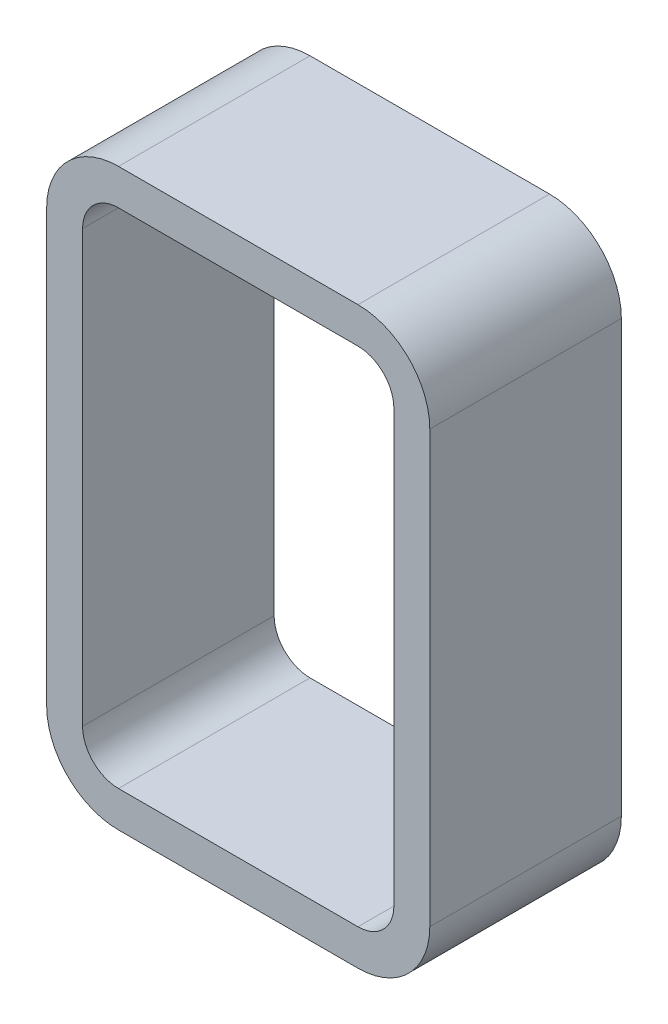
ISO-10303-21;
HEADER;
FILE_DESCRIPTION(('STEP AP214'),'2;1');
FILE_NAME('part.step','',(''),(''),'','','');
FILE_SCHEMA(('AUTOMOTIVE_DESIGN { 1 0 10303 214 1 1 1 1 }'));
ENDSEC;
DATA;
#1=APPLICATION_CONTEXT('core data for automotive mechanical design processes');
#2=APPLICATION_PROTOCOL_DEFINITION('international standard','automotive_design',2000,#1);
#3=PRODUCT_CONTEXT('',#1,'mechanical');
#4=PRODUCT('Part','Part','',(#3));
#5=PRODUCT_RELATED_PRODUCT_CATEGORY('part','',(#4));
#6=PRODUCT_DEFINITION_FORMATION('','',#4);
#7=PRODUCT_DEFINITION_CONTEXT('part definition',#1,'design');
#8=PRODUCT_DEFINITION('design','',#6,#7);
#9=PRODUCT_DEFINITION_SHAPE('','',#8);
#10=(LENGTH_UNIT() NAMED_UNIT(*) SI_UNIT(.MILLI.,.METRE.));
#11=(NAMED_UNIT(*) PLANE_ANGLE_UNIT() SI_UNIT($,.RADIAN.));
#12=(NAMED_UNIT(*) SI_UNIT($,.STERADIAN.) SOLID_ANGLE_UNIT());
#13=UNCERTAINTY_MEASURE_WITH_UNIT(LENGTH_MEASURE(1.E-05),#10,'distance_accuracy_value','');
#14=(GEOMETRIC_REPRESENTATION_CONTEXT(3) GLOBAL_UNCERTAINTY_ASSIGNED_CONTEXT((#13)) GLOBAL_UNIT_ASSIGNED_CONTEXT((#10,
#11,#12)) REPRESENTATION_CONTEXT('',''));
#15=CARTESIAN_POINT('',(0.,0.,0.));
#16=DIRECTION('',(0.,0.,1.));
#17=DIRECTION('',(1.,0.,0.));
#18=AXIS2_PLACEMENT_3D('',#15,#16,#17);
#19=CARTESIAN_POINT('',(41.27496425,66.67500825,12.7));
#20=DIRECTION('',(0.,0.,1.));
#21=DIRECTION('',(1.,0.,0.));
#22=AXIS2_PLACEMENT_3D('',#19,#20,#21);
#23=PLANE('',#22);
#24=CARTESIAN_POINT('',(41.27496425,66.67500825,12.7));
#25=DIRECTION('',(0.,0.,1.));
#26=DIRECTION('',(1.,0.,0.));
#27=AXIS2_PLACEMENT_3D('',#24,#25,#26);
#28=CIRCLE('',#27,9.52499175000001);
#29=CARTESIAN_POINT('',(50.799956,66.67500825,12.7));
#30=VERTEX_POINT('',#29);
#31=CARTESIAN_POINT('',(41.27496425,76.2,12.7));
#32=VERTEX_POINT('',#31);
#33=EDGE_CURVE('E210',#30,#32,#28,.T.);
#34=ORIENTED_EDGE('',*,*,#33,.T.);
#35=DIRECTION('',(-1.,0.,0.));
#36=VECTOR('',#35,1.);
#37=CARTESIAN_POINT('',(41.27496425,76.2,12.7));
#38=LINE('',#37,#36);
#39=CARTESIAN_POINT('',(9.52499174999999,76.2,12.7));
#40=VERTEX_POINT('',#39);
#41=EDGE_CURVE('E213',#32,#40,#38,.T.);
#42=ORIENTED_EDGE('',*,*,#41,.T.);
#43=CARTESIAN_POINT('',(9.52499174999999,66.67500825,12.7));
#44=DIRECTION('',(0.,0.,1.));
#45=DIRECTION('',(1.,0.,0.));
#46=AXIS2_PLACEMENT_3D('',#43,#44,#45);
#47=CIRCLE('',#46,9.52499175);
#48=CARTESIAN_POINT('',(0.,66.67500825,12.7));
#49=VERTEX_POINT('',#48);
#50=EDGE_CURVE('E216',#40,#49,#47,.T.);
#51=ORIENTED_EDGE('',*,*,#50,.T.);
#52=DIRECTION('',(0.,-1.,0.));
#53=VECTOR('',#52,1.);
#54=CARTESIAN_POINT('',(0.,9.52499175,12.7));
#55=LINE('',#54,#53);
#56=CARTESIAN_POINT('',(0.,9.52499175,12.7));
#57=VERTEX_POINT('',#56);
#58=EDGE_CURVE('E218',#49,#57,#55,.T.);
#59=ORIENTED_EDGE('',*,*,#58,.T.);
#60=CARTESIAN_POINT('',(9.52499175,9.52499175,12.7));
#61=DIRECTION('',(0.,0.,1.));
#62=DIRECTION('',(1.,0.,0.));
#63=AXIS2_PLACEMENT_3D('',#60,#61,#62);
#64=CIRCLE('',#63,9.52499175);
#65=CARTESIAN_POINT('',(9.52499175,0.,12.7));
#66=VERTEX_POINT('',#65);
#67=EDGE_CURVE('E220',#57,#66,#64,.T.);
#68=ORIENTED_EDGE('',*,*,#67,.T.);
#69=DIRECTION('',(1.,0.,0.));
#70=VECTOR('',#69,1.);
#71=CARTESIAN_POINT('',(9.52499175,0.,12.7));
#72=LINE('',#71,#70);
#73=CARTESIAN_POINT('',(41.27496425,0.,12.7));
#74=VERTEX_POINT('',#73);
#75=EDGE_CURVE('E222',#66,#74,#72,.T.);
#76=ORIENTED_EDGE('',*,*,#75,.T.);
#77=CARTESIAN_POINT('',(41.27496425,9.52499175,12.7));
#78=DIRECTION('',(0.,0.,1.));
#79=DIRECTION('',(1.,0.,0.));
#80=AXIS2_PLACEMENT_3D('',#77,#78,#79);
#81=CIRCLE('',#80,9.52499175);
#82=CARTESIAN_POINT('',(50.799956,9.52499175,12.7));
#83=VERTEX_POINT('',#82);
#84=EDGE_CURVE('E224',#74,#83,#81,.T.);
#85=ORIENTED_EDGE('',*,*,#84,.T.);
#86=DIRECTION('',(0.,1.,0.));
#87=VECTOR('',#86,1.);
#88=CARTESIAN_POINT('',(50.799956,66.67500825,12.7));
#89=LINE('',#88,#87);
#90=EDGE_CURVE('E226',#83,#30,#89,.T.);
#91=ORIENTED_EDGE('',*,*,#90,.T.);
#92=EDGE_LOOP('',(#34,#42,#51,#59,#68,#76,#85,#91));
#93=FACE_BOUND('',#92,.T.);
#94=DIRECTION('',(0.,-1.,0.));
#95=VECTOR('',#94,1.);
#96=CARTESIAN_POINT('',(4.762495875,9.52499175,12.7));
#97=LINE('',#96,#95);
#98=CARTESIAN_POINT('',(4.76249587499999,66.67500825,12.7));
#99=VERTEX_POINT('',#98);
#100=CARTESIAN_POINT('',(4.762495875,9.52499175,12.7));
#101=VERTEX_POINT('',#100);
#102=EDGE_CURVE('E153',#99,#101,#97,.T.);
#103=ORIENTED_EDGE('',*,*,#102,.F.);
#104=CARTESIAN_POINT('',(9.52499174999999,66.67500825,12.7));
#105=DIRECTION('',(0.,0.,1.));
#106=DIRECTION('',(1.,0.,0.));
#107=AXIS2_PLACEMENT_3D('',#104,#105,#106);
#108=CIRCLE('',#107,4.762495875);
#109=CARTESIAN_POINT('',(9.52499174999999,71.437504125,12.7));
#110=VERTEX_POINT('',#109);
#111=EDGE_CURVE('E145',#110,#99,#108,.T.);
#112=ORIENTED_EDGE('',*,*,#111,.F.);
#113=DIRECTION('',(-1.,0.,0.));
#114=VECTOR('',#113,1.);
#115=CARTESIAN_POINT('',(41.27496425,71.437504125,12.7));
#116=LINE('',#115,#114);
#117=CARTESIAN_POINT('',(41.27496425,71.437504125,12.7));
#118=VERTEX_POINT('',#117);
#119=EDGE_CURVE('E178',#118,#110,#116,.T.);
#120=ORIENTED_EDGE('',*,*,#119,.F.);
#121=CARTESIAN_POINT('',(41.27496425,66.67500825,12.7));
#122=DIRECTION('',(0.,0.,1.));
#123=DIRECTION('',(1.,0.,0.));
#124=AXIS2_PLACEMENT_3D('',#121,#122,#123);
#125=CIRCLE('',#124,4.762495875);
#126=CARTESIAN_POINT('',(46.037460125,66.67500825,12.7));
#127=VERTEX_POINT('',#126);
#128=EDGE_CURVE('E176',#127,#118,#125,.T.);
#129=ORIENTED_EDGE('',*,*,#128,.F.);
#130=DIRECTION('',(0.,1.,0.));
#131=VECTOR('',#130,1.);
#132=CARTESIAN_POINT('',(46.037460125,66.67500825,12.7));
#133=LINE('',#132,#131);
#134=CARTESIAN_POINT('',(46.037460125,9.52499175,12.7));
#135=VERTEX_POINT('',#134);
#136=EDGE_CURVE('E174',#135,#127,#133,.T.);
#137=ORIENTED_EDGE('',*,*,#136,.F.);
#138=CARTESIAN_POINT('',(41.27496425,9.52499175,12.7));
#139=DIRECTION('',(0.,0.,1.));
#140=DIRECTION('',(1.,0.,0.));
#141=AXIS2_PLACEMENT_3D('',#138,#139,#140);
#142=CIRCLE('',#141,4.762495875);
#143=CARTESIAN_POINT('',(41.27496425,4.762495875,12.7));
#144=VERTEX_POINT('',#143);
#145=EDGE_CURVE('E172',#144,#135,#142,.T.);
#146=ORIENTED_EDGE('',*,*,#145,.F.);
#147=DIRECTION('',(1.,0.,0.));
#148=VECTOR('',#147,1.);
#149=CARTESIAN_POINT('',(9.52499175,4.762495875,12.7));
#150=LINE('',#149,#148);
#151=CARTESIAN_POINT('',(9.52499175,4.762495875,12.7));
#152=VERTEX_POINT('',#151);
#153=EDGE_CURVE('E168',#152,#144,#150,.T.);
#154=ORIENTED_EDGE('',*,*,#153,.F.);
#155=CARTESIAN_POINT('',(9.52499175,9.52499175,12.7));
#156=DIRECTION('',(0.,0.,1.));
#157=DIRECTION('',(1.,0.,0.));
#158=AXIS2_PLACEMENT_3D('',#155,#156,#157);
#159=CIRCLE('',#158,4.762495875);
#160=EDGE_CURVE('E166',#101,#152,#159,.T.);
#161=ORIENTED_EDGE('',*,*,#160,.F.);
#162=EDGE_LOOP('',(#103,#112,#120,#129,#137,#146,#154,#161));
#163=FACE_BOUND('',#162,.T.);
#164=ADVANCED_FACE('F32',(#93,#163),#23,.T.);
#165=CARTESIAN_POINT('',(41.27496425,66.67500825,-12.7));
#166=DIRECTION('',(0.,0.,1.));
#167=DIRECTION('',(1.,0.,0.));
#168=AXIS2_PLACEMENT_3D('',#165,#166,#167);
#169=PLANE('',#168);
#170=CARTESIAN_POINT('',(41.27496425,66.67500825,-12.7));
#171=DIRECTION('',(0.,0.,1.));
#172=DIRECTION('',(1.,0.,0.));
#173=AXIS2_PLACEMENT_3D('',#170,#171,#172);
#174=CIRCLE('',#173,9.52499175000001);
#175=CARTESIAN_POINT('',(50.799956,66.67500825,-12.7));
#176=VERTEX_POINT('',#175);
#177=CARTESIAN_POINT('',(41.27496425,76.2,-12.7));
#178=VERTEX_POINT('',#177);
#179=EDGE_CURVE('E161',#176,#178,#174,.T.);
#180=ORIENTED_EDGE('',*,*,#179,.F.);
#181=DIRECTION('',(0.,1.,0.));
#182=VECTOR('',#181,1.);
#183=CARTESIAN_POINT('',(50.799956,66.67500825,-12.7));
#184=LINE('',#183,#182);
#185=CARTESIAN_POINT('',(50.799956,9.52499175,-12.7));
#186=VERTEX_POINT('',#185);
#187=EDGE_CURVE('E214',#186,#176,#184,.T.);
#188=ORIENTED_EDGE('',*,*,#187,.F.);
#189=CARTESIAN_POINT('',(41.27496425,9.52499175,-12.7));
#190=DIRECTION('',(0.,0.,1.));
#191=DIRECTION('',(1.,0.,0.));
#192=AXIS2_PLACEMENT_3D('',#189,#190,#191);
#193=CIRCLE('',#192,9.52499175);
#194=CARTESIAN_POINT('',(41.27496425,0.,-12.7));
#195=VERTEX_POINT('',#194);
#196=EDGE_CURVE('E241',#195,#186,#193,.T.);
#197=ORIENTED_EDGE('',*,*,#196,.F.);
#198=DIRECTION('',(1.,0.,0.));
#199=VECTOR('',#198,1.);
#200=CARTESIAN_POINT('',(9.52499175,0.,-12.7));
#201=LINE('',#200,#199);
#202=CARTESIAN_POINT('',(9.52499175,0.,-12.7));
#203=VERTEX_POINT('',#202);
#204=EDGE_CURVE('E239',#203,#195,#201,.T.);
#205=ORIENTED_EDGE('',*,*,#204,.F.);
#206=CARTESIAN_POINT('',(9.52499175,9.52499175,-12.7));
#207=DIRECTION('',(0.,0.,1.));
#208=DIRECTION('',(1.,0.,0.));
#209=AXIS2_PLACEMENT_3D('',#206,#207,#208);
#210=CIRCLE('',#209,9.52499175);
#211=CARTESIAN_POINT('',(0.,9.52499175,-12.7));
#212=VERTEX_POINT('',#211);
#213=EDGE_CURVE('E237',#212,#203,#210,.T.);
#214=ORIENTED_EDGE('',*,*,#213,.F.);
#215=DIRECTION('',(0.,-1.,0.));
#216=VECTOR('',#215,1.);
#217=CARTESIAN_POINT('',(0.,9.52499175,-12.7));
#218=LINE('',#217,#216);
#219=CARTESIAN_POINT('',(0.,66.67500825,-12.7));
#220=VERTEX_POINT('',#219);
#221=EDGE_CURVE('E235',#220,#212,#218,.T.);
#222=ORIENTED_EDGE('',*,*,#221,.F.);
#223=CARTESIAN_POINT('',(9.52499174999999,66.67500825,-12.7));
#224=DIRECTION('',(0.,0.,1.));
#225=DIRECTION('',(1.,0.,0.));
#226=AXIS2_PLACEMENT_3D('',#223,#224,#225);
#227=CIRCLE('',#226,9.52499175);
#228=CARTESIAN_POINT('',(9.52499174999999,76.2,-12.7));
#229=VERTEX_POINT('',#228);
#230=EDGE_CURVE('E233',#229,#220,#227,.T.);
#231=ORIENTED_EDGE('',*,*,#230,.F.);
#232=DIRECTION('',(-1.,0.,0.));
#233=VECTOR('',#232,1.);
#234=CARTESIAN_POINT('',(41.27496425,76.2,-12.7));
#235=LINE('',#234,#233);
#236=EDGE_CURVE('E231',#178,#229,#235,.T.);
#237=ORIENTED_EDGE('',*,*,#236,.F.);
#238=EDGE_LOOP('',(#180,#188,#197,#205,#214,#222,#231,#237));
#239=FACE_BOUND('',#238,.T.);
#240=CARTESIAN_POINT('',(9.52499174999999,66.67500825,-12.7));
#241=DIRECTION('',(0.,0.,1.));
#242=DIRECTION('',(1.,0.,0.));
#243=AXIS2_PLACEMENT_3D('',#240,#241,#242);
#244=CIRCLE('',#243,4.762495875);
#245=CARTESIAN_POINT('',(9.52499174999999,71.437504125,-12.7));
#246=VERTEX_POINT('',#245);
#247=CARTESIAN_POINT('',(4.76249587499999,66.67500825,-12.7));
#248=VERTEX_POINT('',#247);
#249=EDGE_CURVE('E55',#246,#248,#244,.T.);
#250=ORIENTED_EDGE('',*,*,#249,.T.);
#251=DIRECTION('',(0.,-1.,0.));
#252=VECTOR('',#251,1.);
#253=CARTESIAN_POINT('',(4.762495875,9.52499175,-12.7));
#254=LINE('',#253,#252);
#255=CARTESIAN_POINT('',(4.762495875,9.52499175,-12.7));
#256=VERTEX_POINT('',#255);
#257=EDGE_CURVE('E160',#248,#256,#254,.T.);
#258=ORIENTED_EDGE('',*,*,#257,.T.);
#259=CARTESIAN_POINT('',(9.52499175,9.52499175,-12.7));
#260=DIRECTION('',(0.,0.,1.));
#261=DIRECTION('',(1.,0.,0.));
#262=AXIS2_PLACEMENT_3D('',#259,#260,#261);
#263=CIRCLE('',#262,4.762495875);
#264=CARTESIAN_POINT('',(9.52499175,4.762495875,-12.7));
#265=VERTEX_POINT('',#264);
#266=EDGE_CURVE('E182',#256,#265,#263,.T.);
#267=ORIENTED_EDGE('',*,*,#266,.T.);
#268=DIRECTION('',(1.,0.,0.));
#269=VECTOR('',#268,1.);
#270=CARTESIAN_POINT('',(9.52499175,4.762495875,-12.7));
#271=LINE('',#270,#269);
#272=CARTESIAN_POINT('',(41.27496425,4.762495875,-12.7));
#273=VERTEX_POINT('',#272);
#274=EDGE_CURVE('E185',#265,#273,#271,.T.);
#275=ORIENTED_EDGE('',*,*,#274,.T.);
#276=CARTESIAN_POINT('',(41.27496425,9.52499175,-12.7));
#277=DIRECTION('',(0.,0.,1.));
#278=DIRECTION('',(1.,0.,0.));
#279=AXIS2_PLACEMENT_3D('',#276,#277,#278);
#280=CIRCLE('',#279,4.762495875);
#281=CARTESIAN_POINT('',(46.037460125,9.52499175,-12.7));
#282=VERTEX_POINT('',#281);
#283=EDGE_CURVE('E188',#273,#282,#280,.T.);
#284=ORIENTED_EDGE('',*,*,#283,.T.);
#285=DIRECTION('',(0.,1.,0.));
#286=VECTOR('',#285,1.);
#287=CARTESIAN_POINT('',(46.037460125,66.67500825,-12.7));
#288=LINE('',#287,#286);
#289=CARTESIAN_POINT('',(46.037460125,66.67500825,-12.7));
#290=VERTEX_POINT('',#289);
#291=EDGE_CURVE('E191',#282,#290,#288,.T.);
#292=ORIENTED_EDGE('',*,*,#291,.T.);
#293=CARTESIAN_POINT('',(41.27496425,66.67500825,-12.7));
#294=DIRECTION('',(0.,0.,1.));
#295=DIRECTION('',(1.,0.,0.));
#296=AXIS2_PLACEMENT_3D('',#293,#294,#295);
#297=CIRCLE('',#296,4.762495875);
#298=CARTESIAN_POINT('',(41.27496425,71.437504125,-12.7));
#299=VERTEX_POINT('',#298);
#300=EDGE_CURVE('E194',#290,#299,#297,.T.);
#301=ORIENTED_EDGE('',*,*,#300,.T.);
#302=DIRECTION('',(-1.,0.,0.));
#303=VECTOR('',#302,1.);
#304=CARTESIAN_POINT('',(41.27496425,71.437504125,-12.7));
#305=LINE('',#304,#303);
#306=EDGE_CURVE('E154',#299,#246,#305,.T.);
#307=ORIENTED_EDGE('',*,*,#306,.T.);
#308=EDGE_LOOP('',(#250,#258,#267,#275,#284,#292,#301,#307));
#309=FACE_BOUND('',#308,.T.);
#310=ADVANCED_FACE('F271',(#239,#309),#169,.F.);
#311=CARTESIAN_POINT('',(41.27496425,66.67500825,12.7));
#312=DIRECTION('',(0.,0.,-1.));
#313=DIRECTION('',(-1.,0.,0.));
#314=AXIS2_PLACEMENT_3D('',#311,#312,#313);
#315=CYLINDRICAL_SURFACE('',#314,9.52499175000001);
#316=ORIENTED_EDGE('',*,*,#179,.T.);
#317=DIRECTION('',(0.,0.,-1.));
#318=VECTOR('',#317,1.);
#319=CARTESIAN_POINT('',(41.27496425,76.2,12.7));
#320=LINE('',#319,#318);
#321=EDGE_CURVE('E11',#32,#178,#320,.T.);
#322=ORIENTED_EDGE('',*,*,#321,.F.);
#323=ORIENTED_EDGE('',*,*,#33,.F.);
#324=DIRECTION('',(0.,0.,-1.));
#325=VECTOR('',#324,1.);
#326=CARTESIAN_POINT('',(50.799956,66.67500825,12.7));
#327=LINE('',#326,#325);
#328=EDGE_CURVE('E228',#30,#176,#327,.T.);
#329=ORIENTED_EDGE('',*,*,#328,.T.);
#330=EDGE_LOOP('',(#316,#322,#323,#329));
#331=FACE_BOUND('',#330,.T.);
#332=ADVANCED_FACE('F34',(#331),#315,.T.);
#333=CARTESIAN_POINT('',(41.27496425,76.2,12.7));
#334=DIRECTION('',(0.,-1.,0.));
#335=DIRECTION('',(1.,0.,0.));
#336=AXIS2_PLACEMENT_3D('',#333,#334,#335);
#337=PLANE('',#336);
#338=ORIENTED_EDGE('',*,*,#236,.T.);
#339=DIRECTION('',(0.,0.,-1.));
#340=VECTOR('',#339,1.);
#341=CARTESIAN_POINT('',(9.52499174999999,76.2,12.7));
#342=LINE('',#341,#340);
#343=EDGE_CURVE('E40',#40,#229,#342,.T.);
#344=ORIENTED_EDGE('',*,*,#343,.F.);
#345=ORIENTED_EDGE('',*,*,#41,.F.);
#346=ORIENTED_EDGE('',*,*,#321,.T.);
#347=EDGE_LOOP('',(#338,#344,#345,#346));
#348=FACE_BOUND('',#347,.T.);
#349=ADVANCED_FACE('F288',(#348),#337,.F.);
#350=CARTESIAN_POINT('',(9.52499174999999,66.67500825,12.7));
#351=DIRECTION('',(0.,0.,-1.));
#352=DIRECTION('',(-1.,0.,0.));
#353=AXIS2_PLACEMENT_3D('',#350,#351,#352);
#354=CYLINDRICAL_SURFACE('',#353,9.52499175);
#355=ORIENTED_EDGE('',*,*,#230,.T.);
#356=DIRECTION('',(0.,0.,-1.));
#357=VECTOR('',#356,1.);
#358=CARTESIAN_POINT('',(0.,66.67500825,12.7));
#359=LINE('',#358,#357);
#360=EDGE_CURVE('E258',#49,#220,#359,.T.);
#361=ORIENTED_EDGE('',*,*,#360,.F.);
#362=ORIENTED_EDGE('',*,*,#50,.F.);
#363=ORIENTED_EDGE('',*,*,#343,.T.);
#364=EDGE_LOOP('',(#355,#361,#362,#363));
#365=FACE_BOUND('',#364,.T.);
#366=ADVANCED_FACE('F265',(#365),#354,.T.);
#367=CARTESIAN_POINT('',(0.,9.52499175,12.7));
#368=DIRECTION('',(1.,0.,0.));
#369=DIRECTION('',(0.,1.,0.));
#370=AXIS2_PLACEMENT_3D('',#367,#368,#369);
#371=PLANE('',#370);
#372=ORIENTED_EDGE('',*,*,#221,.T.);
#373=DIRECTION('',(0.,0.,-1.));
#374=VECTOR('',#373,1.);
#375=CARTESIAN_POINT('',(0.,9.52499175,12.7));
#376=LINE('',#375,#374);
#377=EDGE_CURVE('E255',#57,#212,#376,.T.);
#378=ORIENTED_EDGE('',*,*,#377,.F.);
#379=ORIENTED_EDGE('',*,*,#58,.F.);
#380=ORIENTED_EDGE('',*,*,#360,.T.);
#381=EDGE_LOOP('',(#372,#378,#379,#380));
#382=FACE_BOUND('',#381,.T.);
#383=ADVANCED_FACE('F277',(#382),#371,.F.);
#384=CARTESIAN_POINT('',(9.52499175,9.52499175,12.7));
#385=DIRECTION('',(0.,0.,-1.));
#386=DIRECTION('',(-1.,0.,0.));
#387=AXIS2_PLACEMENT_3D('',#384,#385,#386);
#388=CYLINDRICAL_SURFACE('',#387,9.52499175);
#389=ORIENTED_EDGE('',*,*,#213,.T.);
#390=DIRECTION('',(0.,0.,-1.));
#391=VECTOR('',#390,1.);
#392=CARTESIAN_POINT('',(9.52499175,0.,12.7));
#393=LINE('',#392,#391);
#394=EDGE_CURVE('E252',#66,#203,#393,.T.);
#395=ORIENTED_EDGE('',*,*,#394,.F.);
#396=ORIENTED_EDGE('',*,*,#67,.F.);
#397=ORIENTED_EDGE('',*,*,#377,.T.);
#398=EDGE_LOOP('',(#389,#395,#396,#397));
#399=FACE_BOUND('',#398,.T.);
#400=ADVANCED_FACE('F281',(#399),#388,.T.);
#401=CARTESIAN_POINT('',(9.52499175,0.,12.7));
#402=DIRECTION('',(0.,1.,0.));
#403=DIRECTION('',(0.,0.,1.));
#404=AXIS2_PLACEMENT_3D('',#401,#402,#403);
#405=PLANE('',#404);
#406=ORIENTED_EDGE('',*,*,#204,.T.);
#407=DIRECTION('',(0.,0.,-1.));
#408=VECTOR('',#407,1.);
#409=CARTESIAN_POINT('',(41.27496425,0.,12.7));
#410=LINE('',#409,#408);
#411=EDGE_CURVE('E249',#74,#195,#410,.T.);
#412=ORIENTED_EDGE('',*,*,#411,.F.);
#413=ORIENTED_EDGE('',*,*,#75,.F.);
#414=ORIENTED_EDGE('',*,*,#394,.T.);
#415=EDGE_LOOP('',(#406,#412,#413,#414));
#416=FACE_BOUND('',#415,.T.);
#417=ADVANCED_FACE('F301',(#416),#405,.F.);
#418=CARTESIAN_POINT('',(41.27496425,9.52499175,12.7));
#419=DIRECTION('',(0.,0.,-1.));
#420=DIRECTION('',(-1.,0.,0.));
#421=AXIS2_PLACEMENT_3D('',#418,#419,#420);
#422=CYLINDRICAL_SURFACE('',#421,9.52499175);
#423=ORIENTED_EDGE('',*,*,#196,.T.);
#424=DIRECTION('',(0.,0.,-1.));
#425=VECTOR('',#424,1.);
#426=CARTESIAN_POINT('',(50.799956,9.52499175,12.7));
#427=LINE('',#426,#425);
#428=EDGE_CURVE('E246',#83,#186,#427,.T.);
#429=ORIENTED_EDGE('',*,*,#428,.F.);
#430=ORIENTED_EDGE('',*,*,#84,.F.);
#431=ORIENTED_EDGE('',*,*,#411,.T.);
#432=EDGE_LOOP('',(#423,#429,#430,#431));
#433=FACE_BOUND('',#432,.T.);
#434=ADVANCED_FACE('F299',(#433),#422,.T.);
#435=CARTESIAN_POINT('',(50.799956,66.67500825,12.7));
#436=DIRECTION('',(-1.,0.,0.));
#437=DIRECTION('',(0.,-1.,0.));
#438=AXIS2_PLACEMENT_3D('',#435,#436,#437);
#439=PLANE('',#438);
#440=ORIENTED_EDGE('',*,*,#187,.T.);
#441=ORIENTED_EDGE('',*,*,#328,.F.);
#442=ORIENTED_EDGE('',*,*,#90,.F.);
#443=ORIENTED_EDGE('',*,*,#428,.T.);
#444=EDGE_LOOP('',(#440,#441,#442,#443));
#445=FACE_BOUND('',#444,.T.);
#446=ADVANCED_FACE('F294',(#445),#439,.F.);
#447=CARTESIAN_POINT('',(9.52499174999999,66.67500825,12.7));
#448=DIRECTION('',(0.,0.,-1.));
#449=DIRECTION('',(-1.,0.,0.));
#450=AXIS2_PLACEMENT_3D('',#447,#448,#449);
#451=CYLINDRICAL_SURFACE('',#450,4.762495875);
#452=ORIENTED_EDGE('',*,*,#249,.F.);
#453=DIRECTION('',(0.,0.,-1.));
#454=VECTOR('',#453,1.);
#455=CARTESIAN_POINT('',(9.52499174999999,71.437504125,12.7));
#456=LINE('',#455,#454);
#457=EDGE_CURVE('E149',#110,#246,#456,.T.);
#458=ORIENTED_EDGE('',*,*,#457,.F.);
#459=ORIENTED_EDGE('',*,*,#111,.T.);
#460=DIRECTION('',(0.,0.,-1.));
#461=VECTOR('',#460,1.);
#462=CARTESIAN_POINT('',(4.76249587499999,66.67500825,12.7));
#463=LINE('',#462,#461);
#464=EDGE_CURVE('E148',#99,#248,#463,.T.);
#465=ORIENTED_EDGE('',*,*,#464,.T.);
#466=EDGE_LOOP('',(#452,#458,#459,#465));
#467=FACE_BOUND('',#466,.T.);
#468=ADVANCED_FACE('F147',(#467),#451,.F.);
#469=CARTESIAN_POINT('',(4.762495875,9.52499175,12.7));
#470=DIRECTION('',(1.,0.,0.));
#471=DIRECTION('',(0.,1.,0.));
#472=AXIS2_PLACEMENT_3D('',#469,#470,#471);
#473=PLANE('',#472);
#474=ORIENTED_EDGE('',*,*,#257,.F.);
#475=ORIENTED_EDGE('',*,*,#464,.F.);
#476=ORIENTED_EDGE('',*,*,#102,.T.);
#477=DIRECTION('',(0.,0.,-1.));
#478=VECTOR('',#477,1.);
#479=CARTESIAN_POINT('',(4.762495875,9.52499175,12.7));
#480=LINE('',#479,#478);
#481=EDGE_CURVE('E162',#101,#256,#480,.T.);
#482=ORIENTED_EDGE('',*,*,#481,.T.);
#483=EDGE_LOOP('',(#474,#475,#476,#482));
#484=FACE_BOUND('',#483,.T.);
#485=ADVANCED_FACE('F157',(#484),#473,.T.);
#486=CARTESIAN_POINT('',(9.52499175,9.52499175,12.7));
#487=DIRECTION('',(0.,0.,-1.));
#488=DIRECTION('',(-1.,0.,0.));
#489=AXIS2_PLACEMENT_3D('',#486,#487,#488);
#490=CYLINDRICAL_SURFACE('',#489,4.762495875);
#491=ORIENTED_EDGE('',*,*,#266,.F.);
#492=ORIENTED_EDGE('',*,*,#481,.F.);
#493=ORIENTED_EDGE('',*,*,#160,.T.);
#494=DIRECTION('',(0.,0.,-1.));
#495=VECTOR('',#494,1.);
#496=CARTESIAN_POINT('',(9.52499175,4.762495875,12.7));
#497=LINE('',#496,#495);
#498=EDGE_CURVE('E207',#152,#265,#497,.T.);
#499=ORIENTED_EDGE('',*,*,#498,.T.);
#500=EDGE_LOOP('',(#491,#492,#493,#499));
#501=FACE_BOUND('',#500,.T.);
#502=ADVANCED_FACE('F326',(#501),#490,.F.);
#503=CARTESIAN_POINT('',(9.52499175,4.762495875,12.7));
#504=DIRECTION('',(0.,1.,0.));
#505=DIRECTION('',(0.,0.,1.));
#506=AXIS2_PLACEMENT_3D('',#503,#504,#505);
#507=PLANE('',#506);
#508=ORIENTED_EDGE('',*,*,#274,.F.);
#509=ORIENTED_EDGE('',*,*,#498,.F.);
#510=ORIENTED_EDGE('',*,*,#153,.T.);
#511=DIRECTION('',(0.,0.,-1.));
#512=VECTOR('',#511,1.);
#513=CARTESIAN_POINT('',(41.27496425,4.762495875,12.7));
#514=LINE('',#513,#512);
#515=EDGE_CURVE('E205',#144,#273,#514,.T.);
#516=ORIENTED_EDGE('',*,*,#515,.T.);
#517=EDGE_LOOP('',(#508,#509,#510,#516));
#518=FACE_BOUND('',#517,.T.);
#519=ADVANCED_FACE('F330',(#518),#507,.T.);
#520=CARTESIAN_POINT('',(41.27496425,9.52499175,12.7));
#521=DIRECTION('',(0.,0.,-1.));
#522=DIRECTION('',(-1.,0.,0.));
#523=AXIS2_PLACEMENT_3D('',#520,#521,#522);
#524=CYLINDRICAL_SURFACE('',#523,4.762495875);
#525=ORIENTED_EDGE('',*,*,#283,.F.);
#526=ORIENTED_EDGE('',*,*,#515,.F.);
#527=ORIENTED_EDGE('',*,*,#145,.T.);
#528=DIRECTION('',(0.,0.,-1.));
#529=VECTOR('',#528,1.);
#530=CARTESIAN_POINT('',(46.037460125,9.52499175,12.7));
#531=LINE('',#530,#529);
#532=EDGE_CURVE('E203',#135,#282,#531,.T.);
#533=ORIENTED_EDGE('',*,*,#532,.T.);
#534=EDGE_LOOP('',(#525,#526,#527,#533));
#535=FACE_BOUND('',#534,.T.);
#536=ADVANCED_FACE('F336',(#535),#524,.F.);
#537=CARTESIAN_POINT('',(46.037460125,66.67500825,12.7));
#538=DIRECTION('',(-1.,0.,0.));
#539=DIRECTION('',(0.,-1.,0.));
#540=AXIS2_PLACEMENT_3D('',#537,#538,#539);
#541=PLANE('',#540);
#542=ORIENTED_EDGE('',*,*,#291,.F.);
#543=ORIENTED_EDGE('',*,*,#532,.F.);
#544=ORIENTED_EDGE('',*,*,#136,.T.);
#545=DIRECTION('',(0.,0.,-1.));
#546=VECTOR('',#545,1.);
#547=CARTESIAN_POINT('',(46.037460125,66.67500825,12.7));
#548=LINE('',#547,#546);
#549=EDGE_CURVE('E201',#127,#290,#548,.T.);
#550=ORIENTED_EDGE('',*,*,#549,.T.);
#551=EDGE_LOOP('',(#542,#543,#544,#550));
#552=FACE_BOUND('',#551,.T.);
#553=ADVANCED_FACE('F340',(#552),#541,.T.);
#554=CARTESIAN_POINT('',(41.27496425,66.67500825,12.7));
#555=DIRECTION('',(0.,0.,-1.));
#556=DIRECTION('',(-1.,0.,0.));
#557=AXIS2_PLACEMENT_3D('',#554,#555,#556);
#558=CYLINDRICAL_SURFACE('',#557,4.762495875);
#559=ORIENTED_EDGE('',*,*,#300,.F.);
#560=ORIENTED_EDGE('',*,*,#549,.F.);
#561=ORIENTED_EDGE('',*,*,#128,.T.);
#562=DIRECTION('',(0.,0.,-1.));
#563=VECTOR('',#562,1.);
#564=CARTESIAN_POINT('',(41.27496425,71.437504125,12.7));
#565=LINE('',#564,#563);
#566=EDGE_CURVE('E47',#118,#299,#565,.T.);
#567=ORIENTED_EDGE('',*,*,#566,.T.);
#568=EDGE_LOOP('',(#559,#560,#561,#567));
#569=FACE_BOUND('',#568,.T.);
#570=ADVANCED_FACE('F344',(#569),#558,.F.);
#571=CARTESIAN_POINT('',(41.27496425,71.437504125,12.7));
#572=DIRECTION('',(0.,-1.,0.));
#573=DIRECTION('',(0.,0.,-1.));
#574=AXIS2_PLACEMENT_3D('',#571,#572,#573);
#575=PLANE('',#574);
#576=ORIENTED_EDGE('',*,*,#306,.F.);
#577=ORIENTED_EDGE('',*,*,#566,.F.);
#578=ORIENTED_EDGE('',*,*,#119,.T.);
#579=ORIENTED_EDGE('',*,*,#457,.T.);
#580=EDGE_LOOP('',(#576,#577,#578,#579));
#581=FACE_BOUND('',#580,.T.);
#582=ADVANCED_FACE('F348',(#581),#575,.T.);
#583=CLOSED_SHELL('',(#164,#310,#332,#349,#366,#383,#400,#417,#434,#446,#468,#485,#502,#519,
#536,#553,#570,#582));
#584=MANIFOLD_SOLID_BREP('B2',#583);
#585=ADVANCED_BREP_SHAPE_REPRESENTATION('',(#18,#584),#14);
#586=SHAPE_DEFINITION_REPRESENTATION(#9,#585);
ENDSEC;
END-ISO-10303-21;
